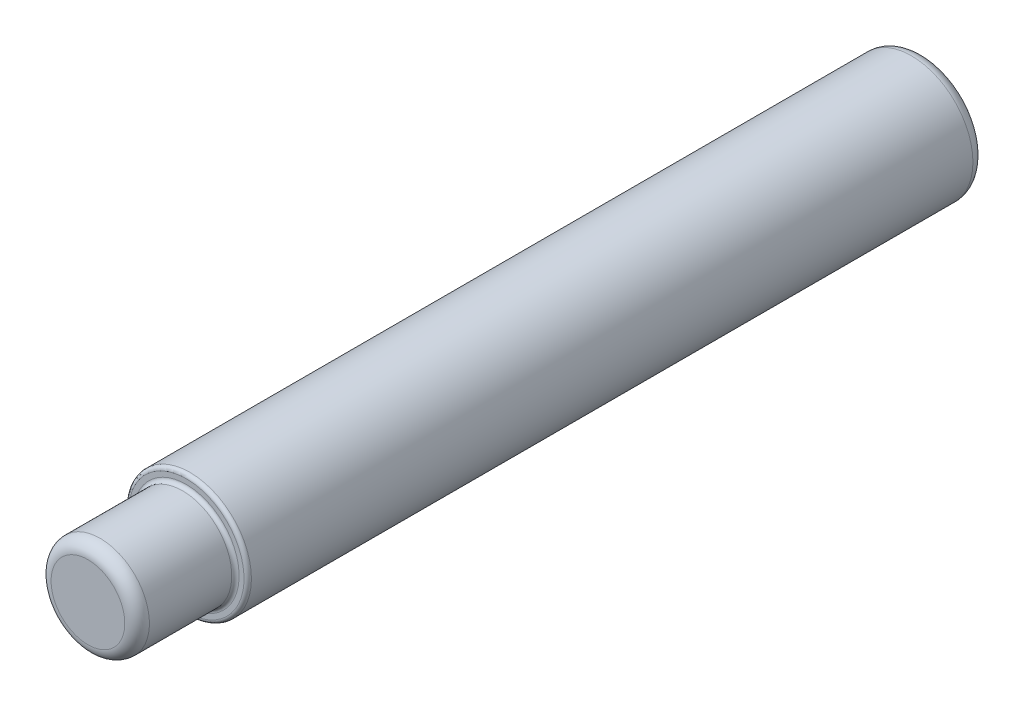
from build123d import *

# Parameters (mm, degrees)
FILLET_1_R = 0.5
FILLET_2_R = 0.15


with BuildPart() as part:
    # Sketch 1 → Revolve 1 (revolve)
    with BuildSketch(Plane(origin=(0, 0, 0), x_dir=(0, 0, -1), z_dir=(1, 0, 0)), mode=Mode.PRIVATE) as revolve_1_sk:
        Polygon((-17, 0), (17, 0), (17, 2.5), (-13, 2.5), (-13, 2), (-17, 2), align=None)
    revolve(revolve_1_sk.sketch.rotate(Axis((0, 0, 17), (0, 0, -1)), 90), axis=Axis((0, 0, 17), (0, 0, -1)))

    # Fillet 1
    fillet_1_edges = [part.edges().sort_by_distance(p)[0] for p in [
        (-2, 0, 17),
        (-2.5, 0, -17),
    ]]
    fillet(fillet_1_edges, radius=FILLET_1_R)

    # Fillet 2
    fillet_2_edges = [part.edges().sort_by_distance(p)[0] for p in [
        (-2, 0, 13),
        (-2.5, 0, 13),
    ]]
    fillet(fillet_2_edges, radius=FILLET_2_R)


solid = part.part
